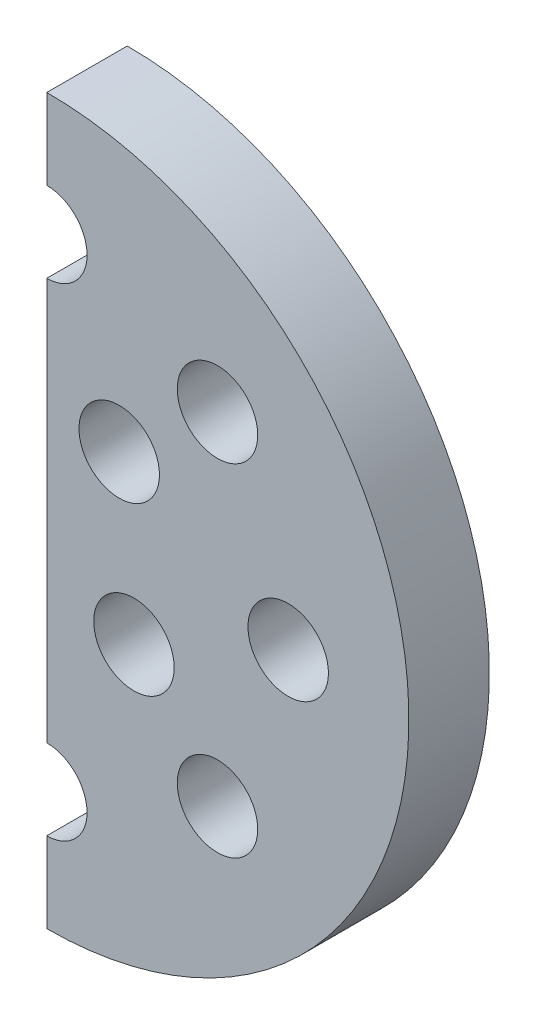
ISO-10303-21;
HEADER;
FILE_DESCRIPTION(('STEP AP214'),'2;1');
FILE_NAME('part.step','',(''),(''),'','','');
FILE_SCHEMA(('AUTOMOTIVE_DESIGN { 1 0 10303 214 1 1 1 1 }'));
ENDSEC;
DATA;
#1=APPLICATION_CONTEXT('core data for automotive mechanical design processes');
#2=APPLICATION_PROTOCOL_DEFINITION('international standard','automotive_design',2000,#1);
#3=PRODUCT_CONTEXT('',#1,'mechanical');
#4=PRODUCT('Part','Part','',(#3));
#5=PRODUCT_RELATED_PRODUCT_CATEGORY('part','',(#4));
#6=PRODUCT_DEFINITION_FORMATION('','',#4);
#7=PRODUCT_DEFINITION_CONTEXT('part definition',#1,'design');
#8=PRODUCT_DEFINITION('design','',#6,#7);
#9=PRODUCT_DEFINITION_SHAPE('','',#8);
#10=(LENGTH_UNIT() NAMED_UNIT(*) SI_UNIT(.MILLI.,.METRE.));
#11=(NAMED_UNIT(*) PLANE_ANGLE_UNIT() SI_UNIT($,.RADIAN.));
#12=(NAMED_UNIT(*) SI_UNIT($,.STERADIAN.) SOLID_ANGLE_UNIT());
#13=UNCERTAINTY_MEASURE_WITH_UNIT(LENGTH_MEASURE(1.E-05),#10,'distance_accuracy_value','');
#14=(GEOMETRIC_REPRESENTATION_CONTEXT(3) GLOBAL_UNCERTAINTY_ASSIGNED_CONTEXT((#13)) GLOBAL_UNIT_ASSIGNED_CONTEXT((#10,
#11,#12)) REPRESENTATION_CONTEXT('',''));
#15=CARTESIAN_POINT('',(0.,0.,0.));
#16=DIRECTION('',(0.,0.,1.));
#17=DIRECTION('',(1.,0.,0.));
#18=AXIS2_PLACEMENT_3D('',#15,#16,#17);
#19=CARTESIAN_POINT('',(0.,0.,50.));
#20=DIRECTION('',(0.,0.,1.));
#21=DIRECTION('',(1.,0.,0.));
#22=AXIS2_PLACEMENT_3D('',#19,#20,#21);
#23=PLANE('',#22);
#24=CARTESIAN_POINT('',(54.1510019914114,-45.0000000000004,50.));
#25=DIRECTION('',(0.,0.,1.));
#26=DIRECTION('',(1.,0.,0.));
#27=AXIS2_PLACEMENT_3D('',#24,#25,#26);
#28=CIRCLE('',#27,25.);
#29=CARTESIAN_POINT('',(79.1510019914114,-45.0000000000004,50.));
#30=VERTEX_POINT('',#29);
#31=EDGE_CURVE('E106',#30,#30,#28,.T.);
#32=ORIENTED_EDGE('',*,*,#31,.F.);
#33=EDGE_LOOP('',(#32));
#34=FACE_BOUND('',#33,.T.);
#35=CARTESIAN_POINT('',(106.066017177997,-106.066017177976,50.));
#36=DIRECTION('',(0.,0.,1.));
#37=DIRECTION('',(1.,0.,0.));
#38=AXIS2_PLACEMENT_3D('',#35,#36,#37);
#39=CIRCLE('',#38,25.0000000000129);
#40=CARTESIAN_POINT('',(131.06601717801,-106.066017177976,50.));
#41=VERTEX_POINT('',#40);
#42=EDGE_CURVE('E128',#41,#41,#39,.T.);
#43=ORIENTED_EDGE('',*,*,#42,.F.);
#44=EDGE_LOOP('',(#43));
#45=FACE_BOUND('',#44,.T.);
#46=CARTESIAN_POINT('',(106.066017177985,106.066017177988,50.));
#47=DIRECTION('',(0.,0.,1.));
#48=DIRECTION('',(1.,0.,0.));
#49=AXIS2_PLACEMENT_3D('',#46,#47,#48);
#50=CIRCLE('',#49,25.0000000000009);
#51=CARTESIAN_POINT('',(131.066017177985,106.066017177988,50.));
#52=VERTEX_POINT('',#51);
#53=EDGE_CURVE('E117',#52,#52,#50,.T.);
#54=ORIENTED_EDGE('',*,*,#53,.F.);
#55=EDGE_LOOP('',(#54));
#56=FACE_BOUND('',#55,.T.);
#57=CARTESIAN_POINT('',(150.000000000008,8.50814312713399E-12,50.));
#58=DIRECTION('',(0.,0.,1.));
#59=DIRECTION('',(1.,0.,0.));
#60=AXIS2_PLACEMENT_3D('',#57,#58,#59);
#61=CIRCLE('',#60,25.0000000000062);
#62=CARTESIAN_POINT('',(175.000000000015,8.50814312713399E-12,50.));
#63=VERTEX_POINT('',#62);
#64=EDGE_CURVE('E122',#63,#63,#61,.T.);
#65=ORIENTED_EDGE('',*,*,#64,.F.);
#66=EDGE_LOOP('',(#65));
#67=FACE_BOUND('',#66,.T.);
#68=CARTESIAN_POINT('',(45.0000000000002,54.1510019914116,50.));
#69=DIRECTION('',(0.,0.,1.));
#70=DIRECTION('',(1.,0.,0.));
#71=AXIS2_PLACEMENT_3D('',#68,#69,#70);
#72=CIRCLE('',#71,25.);
#73=CARTESIAN_POINT('',(70.0000000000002,54.1510019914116,50.));
#74=VERTEX_POINT('',#73);
#75=EDGE_CURVE('E140',#74,#74,#72,.T.);
#76=ORIENTED_EDGE('',*,*,#75,.F.);
#77=EDGE_LOOP('',(#76));
#78=FACE_BOUND('',#77,.T.);
#79=CARTESIAN_POINT('',(0.,0.,50.));
#80=DIRECTION('',(0.,0.,1.));
#81=DIRECTION('',(1.,0.,0.));
#82=AXIS2_PLACEMENT_3D('',#79,#80,#81);
#83=CIRCLE('',#82,225.);
#84=CARTESIAN_POINT('',(0.,-225.,50.));
#85=VERTEX_POINT('',#84);
#86=CARTESIAN_POINT('',(0.,225.,50.));
#87=VERTEX_POINT('',#86);
#88=EDGE_CURVE('E103',#85,#87,#83,.T.);
#89=ORIENTED_EDGE('',*,*,#88,.T.);
#90=DIRECTION('',(0.,-1.,0.));
#91=VECTOR('',#90,1.);
#92=CARTESIAN_POINT('',(0.,0.,50.));
#93=LINE('',#92,#91);
#94=CARTESIAN_POINT('',(0.,175.,50.));
#95=VERTEX_POINT('',#94);
#96=EDGE_CURVE('E89',#87,#95,#93,.T.);
#97=ORIENTED_EDGE('',*,*,#96,.T.);
#98=CARTESIAN_POINT('',(0.,150.,50.));
#99=DIRECTION('',(0.,0.,1.));
#100=DIRECTION('',(1.,0.,0.));
#101=AXIS2_PLACEMENT_3D('',#98,#99,#100);
#102=CIRCLE('',#101,25.);
#103=CARTESIAN_POINT('',(0.,125.,50.));
#104=VERTEX_POINT('',#103);
#105=EDGE_CURVE('E111',#104,#95,#102,.T.);
#106=ORIENTED_EDGE('',*,*,#105,.F.);
#107=CARTESIAN_POINT('',(0.,-124.999999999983,50.));
#108=VERTEX_POINT('',#107);
#109=EDGE_CURVE('E154',#104,#108,#93,.T.);
#110=ORIENTED_EDGE('',*,*,#109,.T.);
#111=CARTESIAN_POINT('',(1.7016286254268E-11,-150.,50.));
#112=DIRECTION('',(0.,0.,1.));
#113=DIRECTION('',(1.,0.,0.));
#114=AXIS2_PLACEMENT_3D('',#111,#112,#113);
#115=CIRCLE('',#114,25.0000000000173);
#116=CARTESIAN_POINT('',(0.,-175.000000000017,50.));
#117=VERTEX_POINT('',#116);
#118=EDGE_CURVE('E134',#117,#108,#115,.T.);
#119=ORIENTED_EDGE('',*,*,#118,.F.);
#120=EDGE_CURVE('E157',#117,#85,#93,.T.);
#121=ORIENTED_EDGE('',*,*,#120,.T.);
#122=EDGE_LOOP('',(#89,#97,#106,#110,#119,#121));
#123=FACE_BOUND('',#122,.T.);
#124=ADVANCED_FACE('F33',(#34,#45,#56,#67,#78,#123),#23,.T.);
#125=CARTESIAN_POINT('',(0.,0.,0.));
#126=DIRECTION('',(0.,0.,1.));
#127=DIRECTION('',(1.,0.,0.));
#128=AXIS2_PLACEMENT_3D('',#125,#126,#127);
#129=PLANE('',#128);
#130=CARTESIAN_POINT('',(106.066017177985,106.066017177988,0.));
#131=DIRECTION('',(0.,0.,1.));
#132=DIRECTION('',(1.,0.,0.));
#133=AXIS2_PLACEMENT_3D('',#130,#131,#132);
#134=CIRCLE('',#133,25.0000000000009);
#135=CARTESIAN_POINT('',(131.066017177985,106.066017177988,0.));
#136=VERTEX_POINT('',#135);
#137=EDGE_CURVE('E119',#136,#136,#134,.T.);
#138=ORIENTED_EDGE('',*,*,#137,.T.);
#139=EDGE_LOOP('',(#138));
#140=FACE_BOUND('',#139,.T.);
#141=CARTESIAN_POINT('',(150.000000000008,8.50814312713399E-12,0.));
#142=DIRECTION('',(0.,0.,1.));
#143=DIRECTION('',(1.,0.,0.));
#144=AXIS2_PLACEMENT_3D('',#141,#142,#143);
#145=CIRCLE('',#144,25.0000000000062);
#146=CARTESIAN_POINT('',(175.000000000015,8.50814312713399E-12,0.));
#147=VERTEX_POINT('',#146);
#148=EDGE_CURVE('E125',#147,#147,#145,.T.);
#149=ORIENTED_EDGE('',*,*,#148,.T.);
#150=EDGE_LOOP('',(#149));
#151=FACE_BOUND('',#150,.T.);
#152=CARTESIAN_POINT('',(106.066017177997,-106.066017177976,0.));
#153=DIRECTION('',(0.,0.,1.));
#154=DIRECTION('',(1.,0.,0.));
#155=AXIS2_PLACEMENT_3D('',#152,#153,#154);
#156=CIRCLE('',#155,25.0000000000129);
#157=CARTESIAN_POINT('',(131.06601717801,-106.066017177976,0.));
#158=VERTEX_POINT('',#157);
#159=EDGE_CURVE('E131',#158,#158,#156,.T.);
#160=ORIENTED_EDGE('',*,*,#159,.T.);
#161=EDGE_LOOP('',(#160));
#162=FACE_BOUND('',#161,.T.);
#163=CARTESIAN_POINT('',(45.0000000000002,54.1510019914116,0.));
#164=DIRECTION('',(0.,0.,1.));
#165=DIRECTION('',(1.,0.,0.));
#166=AXIS2_PLACEMENT_3D('',#163,#164,#165);
#167=CIRCLE('',#166,25.);
#168=CARTESIAN_POINT('',(70.0000000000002,54.1510019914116,0.));
#169=VERTEX_POINT('',#168);
#170=EDGE_CURVE('E143',#169,#169,#167,.T.);
#171=ORIENTED_EDGE('',*,*,#170,.T.);
#172=EDGE_LOOP('',(#171));
#173=FACE_BOUND('',#172,.T.);
#174=CARTESIAN_POINT('',(54.1510019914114,-45.0000000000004,0.));
#175=DIRECTION('',(0.,0.,1.));
#176=DIRECTION('',(1.,0.,0.));
#177=AXIS2_PLACEMENT_3D('',#174,#175,#176);
#178=CIRCLE('',#177,25.);
#179=CARTESIAN_POINT('',(79.1510019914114,-45.0000000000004,0.));
#180=VERTEX_POINT('',#179);
#181=EDGE_CURVE('E102',#180,#180,#178,.T.);
#182=ORIENTED_EDGE('',*,*,#181,.T.);
#183=EDGE_LOOP('',(#182));
#184=FACE_BOUND('',#183,.T.);
#185=DIRECTION('',(0.,1.,0.));
#186=VECTOR('',#185,1.);
#187=CARTESIAN_POINT('',(0.,225.,0.));
#188=LINE('',#187,#186);
#189=CARTESIAN_POINT('',(0.,175.,0.));
#190=VERTEX_POINT('',#189);
#191=CARTESIAN_POINT('',(0.,225.,0.));
#192=VERTEX_POINT('',#191);
#193=EDGE_CURVE('E86',#190,#192,#188,.T.);
#194=ORIENTED_EDGE('',*,*,#193,.T.);
#195=CARTESIAN_POINT('',(0.,0.,0.));
#196=DIRECTION('',(0.,0.,1.));
#197=DIRECTION('',(1.,0.,0.));
#198=AXIS2_PLACEMENT_3D('',#195,#196,#197);
#199=CIRCLE('',#198,225.);
#200=CARTESIAN_POINT('',(0.,-225.,0.));
#201=VERTEX_POINT('',#200);
#202=EDGE_CURVE('E97',#192,#201,#199,.F.);
#203=ORIENTED_EDGE('',*,*,#202,.T.);
#204=CARTESIAN_POINT('',(0.,-175.000000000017,0.));
#205=VERTEX_POINT('',#204);
#206=EDGE_CURVE('E56',#201,#205,#188,.T.);
#207=ORIENTED_EDGE('',*,*,#206,.T.);
#208=CARTESIAN_POINT('',(1.7016286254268E-11,-150.,0.));
#209=DIRECTION('',(0.,0.,1.));
#210=DIRECTION('',(1.,0.,0.));
#211=AXIS2_PLACEMENT_3D('',#208,#209,#210);
#212=CIRCLE('',#211,25.0000000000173);
#213=CARTESIAN_POINT('',(0.,-124.999999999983,0.));
#214=VERTEX_POINT('',#213);
#215=EDGE_CURVE('E137',#205,#214,#212,.T.);
#216=ORIENTED_EDGE('',*,*,#215,.T.);
#217=CARTESIAN_POINT('',(0.,125.,0.));
#218=VERTEX_POINT('',#217);
#219=EDGE_CURVE('E48',#214,#218,#188,.T.);
#220=ORIENTED_EDGE('',*,*,#219,.T.);
#221=CARTESIAN_POINT('',(0.,150.,0.));
#222=DIRECTION('',(0.,0.,1.));
#223=DIRECTION('',(1.,0.,0.));
#224=AXIS2_PLACEMENT_3D('',#221,#222,#223);
#225=CIRCLE('',#224,25.);
#226=EDGE_CURVE('E99',#218,#190,#225,.T.);
#227=ORIENTED_EDGE('',*,*,#226,.T.);
#228=EDGE_LOOP('',(#194,#203,#207,#216,#220,#227));
#229=FACE_BOUND('',#228,.T.);
#230=ADVANCED_FACE('F35',(#140,#151,#162,#173,#184,#229),#129,.F.);
#231=CARTESIAN_POINT('',(0.,150.,50.));
#232=DIRECTION('',(0.,0.,-1.));
#233=DIRECTION('',(-1.,0.,0.));
#234=AXIS2_PLACEMENT_3D('',#231,#232,#233);
#235=CYLINDRICAL_SURFACE('',#234,25.);
#236=ORIENTED_EDGE('',*,*,#105,.T.);
#237=DIRECTION('',(0.,0.,-1.));
#238=VECTOR('',#237,1.);
#239=CARTESIAN_POINT('',(0.,175.,50.));
#240=LINE('',#239,#238);
#241=EDGE_CURVE('E150',#95,#190,#240,.T.);
#242=ORIENTED_EDGE('',*,*,#241,.T.);
#243=ORIENTED_EDGE('',*,*,#226,.F.);
#244=DIRECTION('',(0.,0.,-1.));
#245=VECTOR('',#244,1.);
#246=CARTESIAN_POINT('',(0.,125.,50.));
#247=LINE('',#246,#245);
#248=EDGE_CURVE('E152',#218,#104,#247,.F.);
#249=ORIENTED_EDGE('',*,*,#248,.T.);
#250=EDGE_LOOP('',(#236,#242,#243,#249));
#251=FACE_BOUND('',#250,.T.);
#252=ADVANCED_FACE('F162',(#251),#235,.F.);
#253=CARTESIAN_POINT('',(1.7016286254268E-11,-150.,50.));
#254=DIRECTION('',(0.,0.,-1.));
#255=DIRECTION('',(-1.,0.,0.));
#256=AXIS2_PLACEMENT_3D('',#253,#254,#255);
#257=CYLINDRICAL_SURFACE('',#256,25.0000000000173);
#258=ORIENTED_EDGE('',*,*,#118,.T.);
#259=DIRECTION('',(0.,0.,-1.));
#260=VECTOR('',#259,1.);
#261=CARTESIAN_POINT('',(0.,-124.999999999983,50.));
#262=LINE('',#261,#260);
#263=EDGE_CURVE('E155',#108,#214,#262,.T.);
#264=ORIENTED_EDGE('',*,*,#263,.T.);
#265=ORIENTED_EDGE('',*,*,#215,.F.);
#266=DIRECTION('',(0.,0.,-1.));
#267=VECTOR('',#266,1.);
#268=CARTESIAN_POINT('',(0.,-175.000000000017,50.));
#269=LINE('',#268,#267);
#270=EDGE_CURVE('E159',#205,#117,#269,.F.);
#271=ORIENTED_EDGE('',*,*,#270,.T.);
#272=EDGE_LOOP('',(#258,#264,#265,#271));
#273=FACE_BOUND('',#272,.T.);
#274=ADVANCED_FACE('F167',(#273),#257,.F.);
#275=CARTESIAN_POINT('',(0.,0.,50.));
#276=DIRECTION('',(0.,0.,-1.));
#277=DIRECTION('',(-1.,0.,0.));
#278=AXIS2_PLACEMENT_3D('',#275,#276,#277);
#279=CYLINDRICAL_SURFACE('',#278,225.);
#280=DIRECTION('',(0.,0.,-1.));
#281=VECTOR('',#280,1.);
#282=CARTESIAN_POINT('',(0.,225.,50.));
#283=LINE('',#282,#281);
#284=EDGE_CURVE('E11',#87,#192,#283,.T.);
#285=ORIENTED_EDGE('',*,*,#284,.F.);
#286=ORIENTED_EDGE('',*,*,#88,.F.);
#287=DIRECTION('',(0.,0.,-1.));
#288=VECTOR('',#287,1.);
#289=CARTESIAN_POINT('',(0.,-225.,50.));
#290=LINE('',#289,#288);
#291=EDGE_CURVE('E41',#201,#85,#290,.F.);
#292=ORIENTED_EDGE('',*,*,#291,.F.);
#293=ORIENTED_EDGE('',*,*,#202,.F.);
#294=EDGE_LOOP('',(#285,#286,#292,#293));
#295=FACE_BOUND('',#294,.T.);
#296=ADVANCED_FACE('F101',(#295),#279,.T.);
#297=CARTESIAN_POINT('',(106.066017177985,106.066017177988,50.));
#298=DIRECTION('',(0.,0.,-1.));
#299=DIRECTION('',(-1.,0.,0.));
#300=AXIS2_PLACEMENT_3D('',#297,#298,#299);
#301=CYLINDRICAL_SURFACE('',#300,25.0000000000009);
#302=ORIENTED_EDGE('',*,*,#53,.T.);
#303=EDGE_LOOP('',(#302));
#304=FACE_BOUND('',#303,.T.);
#305=ORIENTED_EDGE('',*,*,#137,.F.);
#306=EDGE_LOOP('',(#305));
#307=FACE_BOUND('',#306,.T.);
#308=ADVANCED_FACE('F195',(#304,#307),#301,.F.);
#309=CARTESIAN_POINT('',(150.000000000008,8.50814312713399E-12,50.));
#310=DIRECTION('',(0.,0.,-1.));
#311=DIRECTION('',(-1.,0.,0.));
#312=AXIS2_PLACEMENT_3D('',#309,#310,#311);
#313=CYLINDRICAL_SURFACE('',#312,25.0000000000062);
#314=ORIENTED_EDGE('',*,*,#64,.T.);
#315=EDGE_LOOP('',(#314));
#316=FACE_BOUND('',#315,.T.);
#317=ORIENTED_EDGE('',*,*,#148,.F.);
#318=EDGE_LOOP('',(#317));
#319=FACE_BOUND('',#318,.T.);
#320=ADVANCED_FACE('F198',(#316,#319),#313,.F.);
#321=CARTESIAN_POINT('',(106.066017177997,-106.066017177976,50.));
#322=DIRECTION('',(0.,0.,-1.));
#323=DIRECTION('',(-1.,0.,0.));
#324=AXIS2_PLACEMENT_3D('',#321,#322,#323);
#325=CYLINDRICAL_SURFACE('',#324,25.0000000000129);
#326=ORIENTED_EDGE('',*,*,#42,.T.);
#327=EDGE_LOOP('',(#326));
#328=FACE_BOUND('',#327,.T.);
#329=ORIENTED_EDGE('',*,*,#159,.F.);
#330=EDGE_LOOP('',(#329));
#331=FACE_BOUND('',#330,.T.);
#332=ADVANCED_FACE('F202',(#328,#331),#325,.F.);
#333=CARTESIAN_POINT('',(45.0000000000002,54.1510019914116,50.));
#334=DIRECTION('',(0.,0.,-1.));
#335=DIRECTION('',(-1.,0.,0.));
#336=AXIS2_PLACEMENT_3D('',#333,#334,#335);
#337=CYLINDRICAL_SURFACE('',#336,25.);
#338=ORIENTED_EDGE('',*,*,#75,.T.);
#339=EDGE_LOOP('',(#338));
#340=FACE_BOUND('',#339,.T.);
#341=ORIENTED_EDGE('',*,*,#170,.F.);
#342=EDGE_LOOP('',(#341));
#343=FACE_BOUND('',#342,.T.);
#344=ADVANCED_FACE('F178',(#340,#343),#337,.F.);
#345=CARTESIAN_POINT('',(54.1510019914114,-45.0000000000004,50.));
#346=DIRECTION('',(0.,0.,-1.));
#347=DIRECTION('',(-1.,0.,0.));
#348=AXIS2_PLACEMENT_3D('',#345,#346,#347);
#349=CYLINDRICAL_SURFACE('',#348,25.);
#350=ORIENTED_EDGE('',*,*,#31,.T.);
#351=EDGE_LOOP('',(#350));
#352=FACE_BOUND('',#351,.T.);
#353=ORIENTED_EDGE('',*,*,#181,.F.);
#354=EDGE_LOOP('',(#353));
#355=FACE_BOUND('',#354,.T.);
#356=ADVANCED_FACE('F170',(#352,#355),#349,.F.);
#357=CARTESIAN_POINT('',(0.,225.,100.));
#358=DIRECTION('',(-1.,0.,0.));
#359=DIRECTION('',(0.,0.,1.));
#360=AXIS2_PLACEMENT_3D('',#357,#358,#359);
#361=PLANE('',#360);
#362=ORIENTED_EDGE('',*,*,#270,.F.);
#363=ORIENTED_EDGE('',*,*,#206,.F.);
#364=ORIENTED_EDGE('',*,*,#291,.T.);
#365=ORIENTED_EDGE('',*,*,#120,.F.);
#366=EDGE_LOOP('',(#362,#363,#364,#365));
#367=FACE_BOUND('',#366,.T.);
#368=ADVANCED_FACE('F168',(#367),#361,.T.);
#369=ORIENTED_EDGE('',*,*,#284,.T.);
#370=ORIENTED_EDGE('',*,*,#193,.F.);
#371=ORIENTED_EDGE('',*,*,#241,.F.);
#372=ORIENTED_EDGE('',*,*,#96,.F.);
#373=EDGE_LOOP('',(#369,#370,#371,#372));
#374=FACE_BOUND('',#373,.T.);
#375=ADVANCED_FACE('F85',(#374),#361,.T.);
#376=ORIENTED_EDGE('',*,*,#219,.F.);
#377=ORIENTED_EDGE('',*,*,#263,.F.);
#378=ORIENTED_EDGE('',*,*,#109,.F.);
#379=ORIENTED_EDGE('',*,*,#248,.F.);
#380=EDGE_LOOP('',(#376,#377,#378,#379));
#381=FACE_BOUND('',#380,.T.);
#382=ADVANCED_FACE('F172',(#381),#361,.T.);
#383=CLOSED_SHELL('',(#124,#230,#252,#274,#296,#308,#320,#332,#344,#356,#368,#375,#382));
#384=MANIFOLD_SOLID_BREP('B2',#383);
#385=ADVANCED_BREP_SHAPE_REPRESENTATION('',(#18,#384),#14);
#386=SHAPE_DEFINITION_REPRESENTATION(#9,#385);
ENDSEC;
END-ISO-10303-21;
